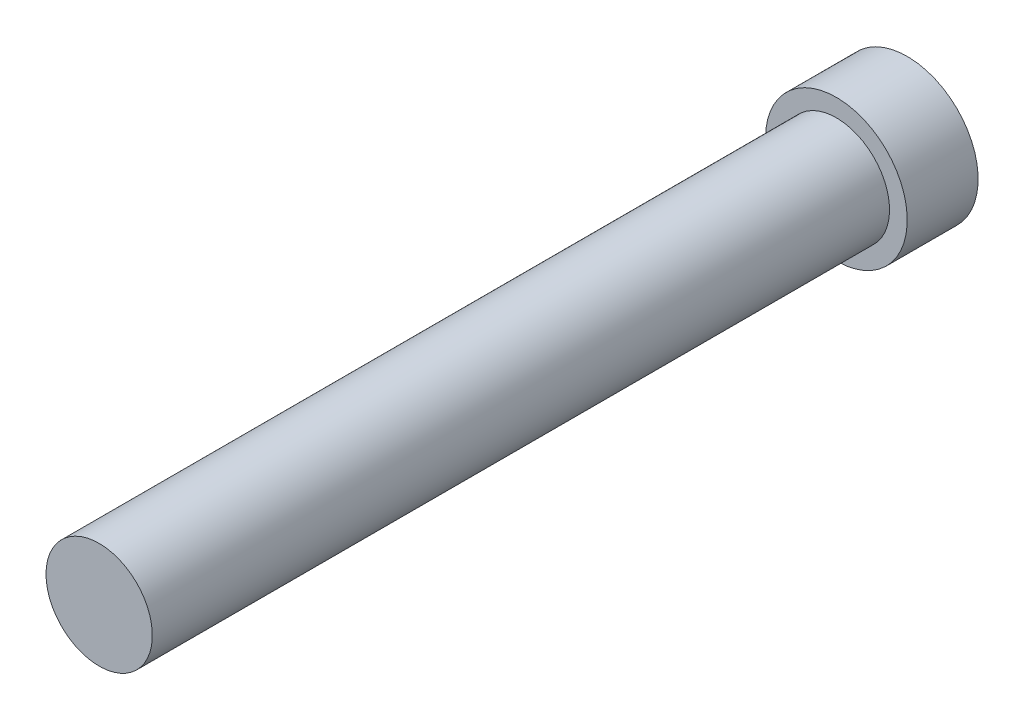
ISO-10303-21;
HEADER;
FILE_DESCRIPTION(('STEP AP214'),'2;1');
FILE_NAME('part.step','',(''),(''),'','','');
FILE_SCHEMA(('AUTOMOTIVE_DESIGN { 1 0 10303 214 1 1 1 1 }'));
ENDSEC;
DATA;
#1=APPLICATION_CONTEXT('core data for automotive mechanical design processes');
#2=APPLICATION_PROTOCOL_DEFINITION('international standard','automotive_design',2000,#1);
#3=PRODUCT_CONTEXT('',#1,'mechanical');
#4=PRODUCT('Part','Part','',(#3));
#5=PRODUCT_RELATED_PRODUCT_CATEGORY('part','',(#4));
#6=PRODUCT_DEFINITION_FORMATION('','',#4);
#7=PRODUCT_DEFINITION_CONTEXT('part definition',#1,'design');
#8=PRODUCT_DEFINITION('design','',#6,#7);
#9=PRODUCT_DEFINITION_SHAPE('','',#8);
#10=(LENGTH_UNIT() NAMED_UNIT(*) SI_UNIT(.MILLI.,.METRE.));
#11=(NAMED_UNIT(*) PLANE_ANGLE_UNIT() SI_UNIT($,.RADIAN.));
#12=(NAMED_UNIT(*) SI_UNIT($,.STERADIAN.) SOLID_ANGLE_UNIT());
#13=UNCERTAINTY_MEASURE_WITH_UNIT(LENGTH_MEASURE(1.E-05),#10,'distance_accuracy_value','');
#14=(GEOMETRIC_REPRESENTATION_CONTEXT(3) GLOBAL_UNCERTAINTY_ASSIGNED_CONTEXT((#13)) GLOBAL_UNIT_ASSIGNED_CONTEXT((#10,
#11,#12)) REPRESENTATION_CONTEXT('',''));
#15=CARTESIAN_POINT('',(0.,0.,0.));
#16=DIRECTION('',(0.,0.,1.));
#17=DIRECTION('',(1.,0.,0.));
#18=AXIS2_PLACEMENT_3D('',#15,#16,#17);
#19=CARTESIAN_POINT('',(0.,0.,-16.5467541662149));
#20=DIRECTION('',(0.,0.,-1.));
#21=DIRECTION('',(-1.,0.,0.));
#22=AXIS2_PLACEMENT_3D('',#19,#20,#21);
#23=CYLINDRICAL_SURFACE('',#22,3.175);
#24=CARTESIAN_POINT('',(0.,0.,-3.175));
#25=DIRECTION('',(0.,0.,-1.));
#26=DIRECTION('',(-1.,0.,0.));
#27=AXIS2_PLACEMENT_3D('',#24,#25,#26);
#28=CIRCLE('',#27,3.175);
#29=CARTESIAN_POINT('',(-3.175,0.,-3.175));
#30=VERTEX_POINT('',#29);
#31=EDGE_CURVE('E58',#30,#30,#28,.T.);
#32=ORIENTED_EDGE('',*,*,#31,.F.);
#33=EDGE_LOOP('',(#32));
#34=FACE_BOUND('',#33,.T.);
#35=CARTESIAN_POINT('',(0.,0.,0.));
#36=DIRECTION('',(0.,0.,-1.));
#37=DIRECTION('',(-1.,0.,0.));
#38=AXIS2_PLACEMENT_3D('',#35,#36,#37);
#39=CIRCLE('',#38,3.175);
#40=CARTESIAN_POINT('',(-3.175,0.,0.));
#41=VERTEX_POINT('',#40);
#42=EDGE_CURVE('E10',#41,#41,#39,.T.);
#43=ORIENTED_EDGE('',*,*,#42,.T.);
#44=EDGE_LOOP('',(#43));
#45=FACE_BOUND('',#44,.T.);
#46=ADVANCED_FACE('F39',(#34,#45),#23,.T.);
#47=CARTESIAN_POINT('',(-2.38125,0.,0.));
#48=DIRECTION('',(0.,0.,-1.));
#49=DIRECTION('',(-1.,0.,0.));
#50=AXIS2_PLACEMENT_3D('',#47,#48,#49);
#51=PLANE('',#50);
#52=ORIENTED_EDGE('',*,*,#42,.F.);
#53=EDGE_LOOP('',(#52));
#54=FACE_BOUND('',#53,.T.);
#55=CARTESIAN_POINT('',(0.,0.,0.));
#56=DIRECTION('',(0.,0.,-1.));
#57=DIRECTION('',(-1.,0.,0.));
#58=AXIS2_PLACEMENT_3D('',#55,#56,#57);
#59=CIRCLE('',#58,2.38125);
#60=CARTESIAN_POINT('',(-2.38125,0.,0.));
#61=VERTEX_POINT('',#60);
#62=EDGE_CURVE('E46',#61,#61,#59,.T.);
#63=ORIENTED_EDGE('',*,*,#62,.T.);
#64=EDGE_LOOP('',(#63));
#65=FACE_BOUND('',#64,.T.);
#66=ADVANCED_FACE('F69',(#54,#65),#51,.F.);
#67=CARTESIAN_POINT('',(0.,0.,-16.5467541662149));
#68=DIRECTION('',(0.,0.,-1.));
#69=DIRECTION('',(-1.,0.,0.));
#70=AXIS2_PLACEMENT_3D('',#67,#68,#69);
#71=CYLINDRICAL_SURFACE('',#70,2.38125);
#72=ORIENTED_EDGE('',*,*,#62,.F.);
#73=EDGE_LOOP('',(#72));
#74=FACE_BOUND('',#73,.T.);
#75=CARTESIAN_POINT('',(0.,0.,33.02));
#76=DIRECTION('',(0.,0.,-1.));
#77=DIRECTION('',(-1.,0.,0.));
#78=AXIS2_PLACEMENT_3D('',#75,#76,#77);
#79=CIRCLE('',#78,2.38125);
#80=CARTESIAN_POINT('',(-2.38125,0.,33.02));
#81=VERTEX_POINT('',#80);
#82=EDGE_CURVE('E52',#81,#81,#79,.T.);
#83=ORIENTED_EDGE('',*,*,#82,.T.);
#84=EDGE_LOOP('',(#83));
#85=FACE_BOUND('',#84,.T.);
#86=ADVANCED_FACE('F73',(#74,#85),#71,.T.);
#87=CARTESIAN_POINT('',(0.,0.,33.02));
#88=DIRECTION('',(0.,0.,-1.));
#89=DIRECTION('',(-1.,0.,0.));
#90=AXIS2_PLACEMENT_3D('',#87,#88,#89);
#91=PLANE('',#90);
#92=ORIENTED_EDGE('',*,*,#82,.F.);
#93=EDGE_LOOP('',(#92));
#94=FACE_BOUND('',#93,.T.);
#95=ADVANCED_FACE('F78',(#94),#91,.F.);
#96=CARTESIAN_POINT('',(0.,0.,-3.175));
#97=DIRECTION('',(0.,0.,1.));
#98=DIRECTION('',(1.,0.,0.));
#99=AXIS2_PLACEMENT_3D('',#96,#97,#98);
#100=PLANE('',#99);
#101=ORIENTED_EDGE('',*,*,#31,.T.);
#102=EDGE_LOOP('',(#101));
#103=FACE_BOUND('',#102,.T.);
#104=ADVANCED_FACE('F66',(#103),#100,.F.);
#105=CLOSED_SHELL('',(#46,#66,#86,#95,#104));
#106=MANIFOLD_SOLID_BREP('B2',#105);
#107=ADVANCED_BREP_SHAPE_REPRESENTATION('',(#18,#106),#14);
#108=SHAPE_DEFINITION_REPRESENTATION(#9,#107);
ENDSEC;
END-ISO-10303-21;
